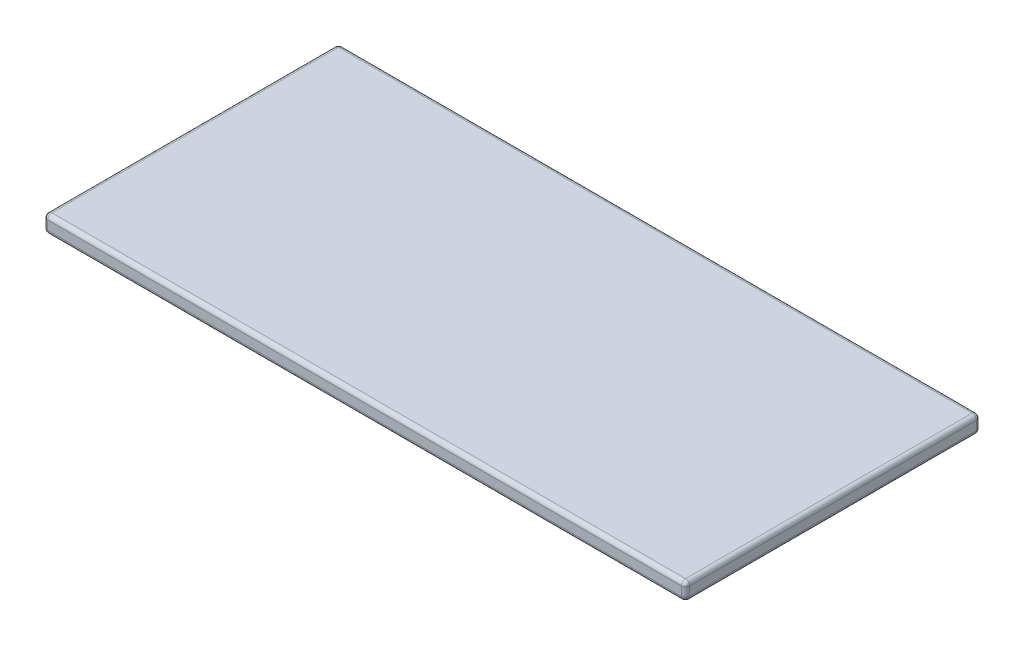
from build123d import *

# Parameters (mm, degrees)
ESQUISSE1_W      = 1850
ESQUISSE1_H      = 850
EXTRUSION1_DEPTH = 50
CONG_1_R         = 12


with BuildPart() as part:
    # Esquisse1 → Extrusion1 (new body)
    with BuildSketch(Plane(origin=(0, 0, 0), x_dir=(1, 0, 0), z_dir=(0, 1, 0))):
        Rectangle(ESQUISSE1_W, ESQUISSE1_H)
    extrude(amount=-EXTRUSION1_DEPTH)

    # Cong_1
    cong_1_edges = [part.edges().sort_by_distance(p)[0] for p in [
        (925, -50, 0),
        (0, -50, -425),
        (-925, -50, 0),
        (0, 0, -425),
        (925, 0, 0),
        (0, 0, 425),
        (-925, 0, 0),
        (0, -50, 425),
        (-925, -25, -425),
        (925, -25, -425),
        (925, -25, 425),
        (-925, -25, 425),
    ]]
    fillet(cong_1_edges, radius=CONG_1_R)


solid = part.part
